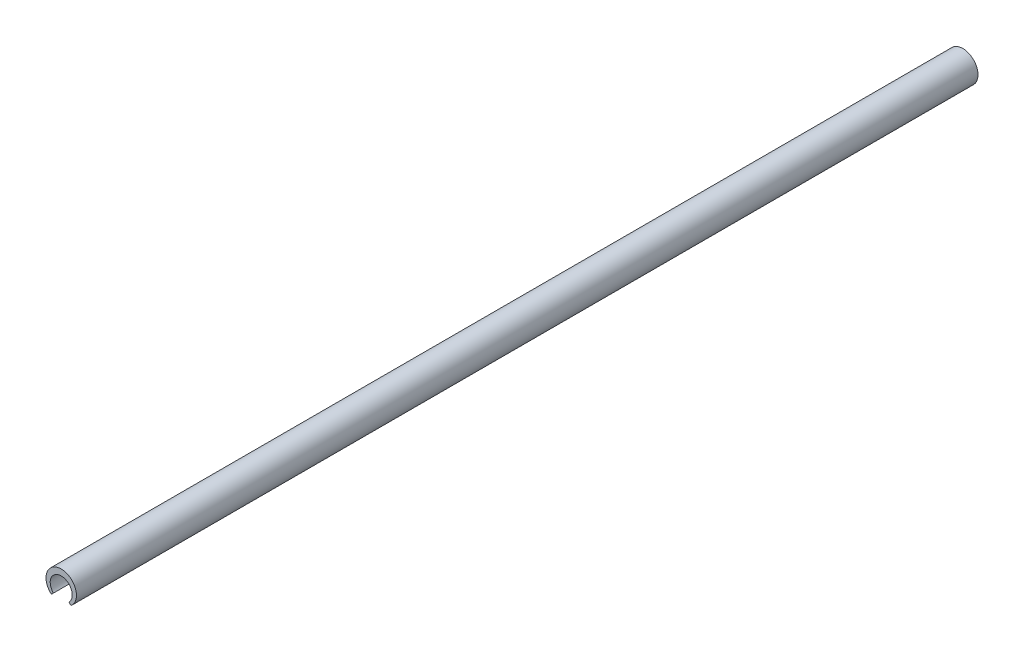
ISO-10303-21;
HEADER;
FILE_DESCRIPTION(('STEP AP214'),'2;1');
FILE_NAME('part.step','',(''),(''),'','','');
FILE_SCHEMA(('AUTOMOTIVE_DESIGN { 1 0 10303 214 1 1 1 1 }'));
ENDSEC;
DATA;
#1=APPLICATION_CONTEXT('core data for automotive mechanical design processes');
#2=APPLICATION_PROTOCOL_DEFINITION('international standard','automotive_design',2000,#1);
#3=PRODUCT_CONTEXT('',#1,'mechanical');
#4=PRODUCT('Part','Part','',(#3));
#5=PRODUCT_RELATED_PRODUCT_CATEGORY('part','',(#4));
#6=PRODUCT_DEFINITION_FORMATION('','',#4);
#7=PRODUCT_DEFINITION_CONTEXT('part definition',#1,'design');
#8=PRODUCT_DEFINITION('design','',#6,#7);
#9=PRODUCT_DEFINITION_SHAPE('','',#8);
#10=(LENGTH_UNIT() NAMED_UNIT(*) SI_UNIT(.MILLI.,.METRE.));
#11=(NAMED_UNIT(*) PLANE_ANGLE_UNIT() SI_UNIT($,.RADIAN.));
#12=(NAMED_UNIT(*) SI_UNIT($,.STERADIAN.) SOLID_ANGLE_UNIT());
#13=UNCERTAINTY_MEASURE_WITH_UNIT(LENGTH_MEASURE(1.E-05),#10,'distance_accuracy_value','');
#14=(GEOMETRIC_REPRESENTATION_CONTEXT(3) GLOBAL_UNCERTAINTY_ASSIGNED_CONTEXT((#13)) GLOBAL_UNIT_ASSIGNED_CONTEXT((#10,
#11,#12)) REPRESENTATION_CONTEXT('',''));
#15=CARTESIAN_POINT('',(0.,0.,0.));
#16=DIRECTION('',(0.,0.,1.));
#17=DIRECTION('',(1.,0.,0.));
#18=AXIS2_PLACEMENT_3D('',#15,#16,#17);
#19=CARTESIAN_POINT('',(4.24264068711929,-4.24264068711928,500.));
#20=DIRECTION('',(0.707106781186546,0.707106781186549,0.));
#21=DIRECTION('',(-0.707106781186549,0.707106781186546,0.));
#22=AXIS2_PLACEMENT_3D('',#19,#20,#21);
#23=PLANE('',#22);
#24=DIRECTION('',(0.707106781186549,-0.707106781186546,0.));
#25=VECTOR('',#24,1.);
#26=CARTESIAN_POINT('',(4.24264068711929,-4.24264068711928,500.));
#27=LINE('',#26,#25);
#28=CARTESIAN_POINT('',(4.31335136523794,-4.31335136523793,500.));
#29=VERTEX_POINT('',#28);
#30=CARTESIAN_POINT('',(5.44483507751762,-5.4448350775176,500.));
#31=VERTEX_POINT('',#30);
#32=EDGE_CURVE('E67',#29,#31,#27,.T.);
#33=ORIENTED_EDGE('',*,*,#32,.F.);
#34=DIRECTION('',(0.,0.,-1.));
#35=VECTOR('',#34,1.);
#36=CARTESIAN_POINT('',(4.31335136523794,-4.31335136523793,500.));
#37=LINE('',#36,#35);
#38=CARTESIAN_POINT('',(4.31335136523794,-4.31335136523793,0.));
#39=VERTEX_POINT('',#38);
#40=EDGE_CURVE('E72',#29,#39,#37,.T.);
#41=ORIENTED_EDGE('',*,*,#40,.T.);
#42=DIRECTION('',(0.707106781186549,-0.707106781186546,0.));
#43=VECTOR('',#42,1.);
#44=CARTESIAN_POINT('',(4.24264068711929,-4.24264068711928,0.));
#45=LINE('',#44,#43);
#46=CARTESIAN_POINT('',(5.44483507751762,-5.4448350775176,0.));
#47=VERTEX_POINT('',#46);
#48=EDGE_CURVE('E59',#39,#47,#45,.T.);
#49=ORIENTED_EDGE('',*,*,#48,.T.);
#50=DIRECTION('',(0.,0.,-1.));
#51=VECTOR('',#50,1.);
#52=CARTESIAN_POINT('',(5.44483507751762,-5.4448350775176,500.));
#53=LINE('',#52,#51);
#54=EDGE_CURVE('E21',#31,#47,#53,.T.);
#55=ORIENTED_EDGE('',*,*,#54,.F.);
#56=EDGE_LOOP('',(#33,#41,#49,#55));
#57=FACE_BOUND('',#56,.T.);
#58=ADVANCED_FACE('F14',(#57),#23,.F.);
#59=CARTESIAN_POINT('',(0.,1.,500.));
#60=DIRECTION('',(0.,0.,-1.));
#61=DIRECTION('',(-1.,0.,0.));
#62=AXIS2_PLACEMENT_3D('',#59,#60,#61);
#63=CYLINDRICAL_SURFACE('',#62,8.4369501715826);
#64=CARTESIAN_POINT('',(0.,1.,0.));
#65=DIRECTION('',(0.,0.,1.));
#66=DIRECTION('',(1.,0.,0.));
#67=AXIS2_PLACEMENT_3D('',#64,#65,#66);
#68=CIRCLE('',#67,8.4369501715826);
#69=CARTESIAN_POINT('',(-5.44483507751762,-5.4448350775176,0.));
#70=VERTEX_POINT('',#69);
#71=EDGE_CURVE('E49',#47,#70,#68,.T.);
#72=ORIENTED_EDGE('',*,*,#71,.T.);
#73=DIRECTION('',(0.,0.,-1.));
#74=VECTOR('',#73,1.);
#75=CARTESIAN_POINT('',(-5.44483507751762,-5.4448350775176,500.));
#76=LINE('',#75,#74);
#77=CARTESIAN_POINT('',(-5.44483507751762,-5.4448350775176,500.));
#78=VERTEX_POINT('',#77);
#79=EDGE_CURVE('E52',#78,#70,#76,.T.);
#80=ORIENTED_EDGE('',*,*,#79,.F.);
#81=CARTESIAN_POINT('',(0.,1.,500.));
#82=DIRECTION('',(0.,0.,1.));
#83=DIRECTION('',(1.,0.,0.));
#84=AXIS2_PLACEMENT_3D('',#81,#82,#83);
#85=CIRCLE('',#84,8.4369501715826);
#86=EDGE_CURVE('E36',#31,#78,#85,.T.);
#87=ORIENTED_EDGE('',*,*,#86,.F.);
#88=ORIENTED_EDGE('',*,*,#54,.T.);
#89=EDGE_LOOP('',(#72,#80,#87,#88));
#90=FACE_BOUND('',#89,.T.);
#91=ADVANCED_FACE('F51',(#90),#63,.T.);
#92=CARTESIAN_POINT('',(-4.24264068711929,-4.24264068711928,500.));
#93=DIRECTION('',(-0.707106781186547,0.707106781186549,0.));
#94=DIRECTION('',(-0.707106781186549,-0.707106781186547,0.));
#95=AXIS2_PLACEMENT_3D('',#92,#93,#94);
#96=PLANE('',#95);
#97=DIRECTION('',(0.707106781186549,0.707106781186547,0.));
#98=VECTOR('',#97,1.);
#99=CARTESIAN_POINT('',(-4.24264068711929,-4.24264068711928,0.));
#100=LINE('',#99,#98);
#101=CARTESIAN_POINT('',(-4.31335136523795,-4.31335136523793,0.));
#102=VERTEX_POINT('',#101);
#103=EDGE_CURVE('E58',#70,#102,#100,.T.);
#104=ORIENTED_EDGE('',*,*,#103,.T.);
#105=DIRECTION('',(0.,0.,-1.));
#106=VECTOR('',#105,1.);
#107=CARTESIAN_POINT('',(-4.31335136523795,-4.31335136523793,500.));
#108=LINE('',#107,#106);
#109=CARTESIAN_POINT('',(-4.31335136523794,-4.31335136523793,500.));
#110=VERTEX_POINT('',#109);
#111=EDGE_CURVE('E28',#102,#110,#108,.F.);
#112=ORIENTED_EDGE('',*,*,#111,.T.);
#113=DIRECTION('',(0.707106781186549,0.707106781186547,0.));
#114=VECTOR('',#113,1.);
#115=CARTESIAN_POINT('',(-4.24264068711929,-4.24264068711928,500.));
#116=LINE('',#115,#114);
#117=EDGE_CURVE('E64',#78,#110,#116,.T.);
#118=ORIENTED_EDGE('',*,*,#117,.F.);
#119=ORIENTED_EDGE('',*,*,#79,.T.);
#120=EDGE_LOOP('',(#104,#112,#118,#119));
#121=FACE_BOUND('',#120,.T.);
#122=ADVANCED_FACE('F63',(#121),#96,.F.);
#123=CARTESIAN_POINT('',(0.,0.,500.));
#124=DIRECTION('',(0.,0.,1.));
#125=DIRECTION('',(1.,0.,0.));
#126=AXIS2_PLACEMENT_3D('',#123,#124,#125);
#127=PLANE('',#126);
#128=CARTESIAN_POINT('',(0.,0.,500.));
#129=DIRECTION('',(0.,0.,-1.));
#130=DIRECTION('',(-1.,0.,0.));
#131=AXIS2_PLACEMENT_3D('',#128,#129,#130);
#132=CIRCLE('',#131,6.1);
#133=EDGE_CURVE('E78',#110,#29,#132,.T.);
#134=ORIENTED_EDGE('',*,*,#133,.T.);
#135=ORIENTED_EDGE('',*,*,#32,.T.);
#136=ORIENTED_EDGE('',*,*,#86,.T.);
#137=ORIENTED_EDGE('',*,*,#117,.T.);
#138=EDGE_LOOP('',(#134,#135,#136,#137));
#139=FACE_BOUND('',#138,.T.);
#140=ADVANCED_FACE('F82',(#139),#127,.T.);
#141=CARTESIAN_POINT('',(0.,0.,0.));
#142=DIRECTION('',(0.,0.,1.));
#143=DIRECTION('',(1.,0.,0.));
#144=AXIS2_PLACEMENT_3D('',#141,#142,#143);
#145=PLANE('',#144);
#146=ORIENTED_EDGE('',*,*,#48,.F.);
#147=CARTESIAN_POINT('',(0.,0.,0.));
#148=DIRECTION('',(0.,0.,1.));
#149=DIRECTION('',(1.,0.,0.));
#150=AXIS2_PLACEMENT_3D('',#147,#148,#149);
#151=CIRCLE('',#150,6.1);
#152=EDGE_CURVE('E9',#39,#102,#151,.T.);
#153=ORIENTED_EDGE('',*,*,#152,.T.);
#154=ORIENTED_EDGE('',*,*,#103,.F.);
#155=ORIENTED_EDGE('',*,*,#71,.F.);
#156=EDGE_LOOP('',(#146,#153,#154,#155));
#157=FACE_BOUND('',#156,.T.);
#158=ADVANCED_FACE('F66',(#157),#145,.F.);
#159=CARTESIAN_POINT('',(0.,0.,500.));
#160=DIRECTION('',(0.,0.,-1.));
#161=DIRECTION('',(-1.,0.,0.));
#162=AXIS2_PLACEMENT_3D('',#159,#160,#161);
#163=CYLINDRICAL_SURFACE('',#162,6.1);
#164=ORIENTED_EDGE('',*,*,#133,.F.);
#165=ORIENTED_EDGE('',*,*,#111,.F.);
#166=ORIENTED_EDGE('',*,*,#152,.F.);
#167=ORIENTED_EDGE('',*,*,#40,.F.);
#168=EDGE_LOOP('',(#164,#165,#166,#167));
#169=FACE_BOUND('',#168,.T.);
#170=ADVANCED_FACE('F88',(#169),#163,.F.);
#171=CLOSED_SHELL('',(#58,#91,#122,#140,#158,#170));
#172=MANIFOLD_SOLID_BREP('B1',#171);
#173=ADVANCED_BREP_SHAPE_REPRESENTATION('',(#18,#172),#14);
#174=SHAPE_DEFINITION_REPRESENTATION(#9,#173);
ENDSEC;
END-ISO-10303-21;
